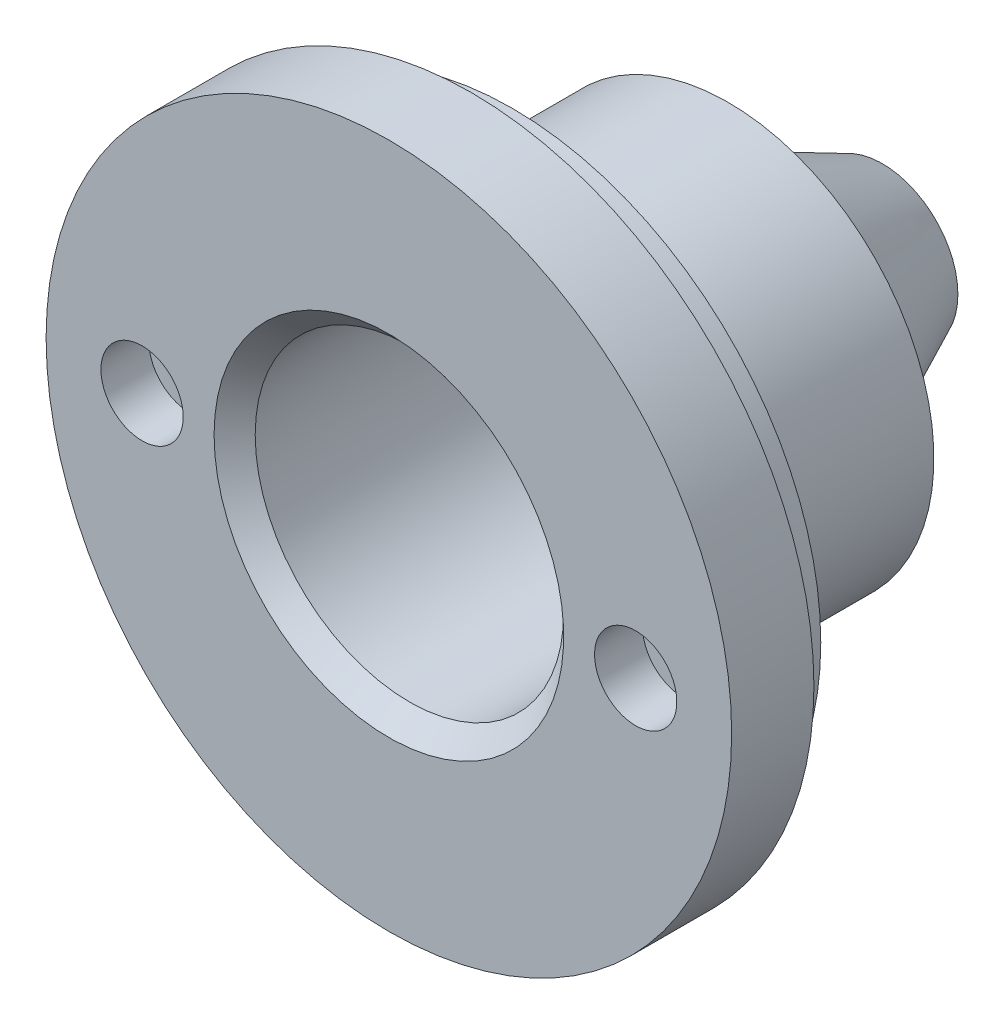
ISO-10303-21;
HEADER;
FILE_DESCRIPTION(('STEP AP214'),'2;1');
FILE_NAME('part.step','',(''),(''),'','','');
FILE_SCHEMA(('AUTOMOTIVE_DESIGN { 1 0 10303 214 1 1 1 1 }'));
ENDSEC;
DATA;
#1=APPLICATION_CONTEXT('core data for automotive mechanical design processes');
#2=APPLICATION_PROTOCOL_DEFINITION('international standard','automotive_design',2000,#1);
#3=PRODUCT_CONTEXT('',#1,'mechanical');
#4=PRODUCT('Part','Part','',(#3));
#5=PRODUCT_RELATED_PRODUCT_CATEGORY('part','',(#4));
#6=PRODUCT_DEFINITION_FORMATION('','',#4);
#7=PRODUCT_DEFINITION_CONTEXT('part definition',#1,'design');
#8=PRODUCT_DEFINITION('design','',#6,#7);
#9=PRODUCT_DEFINITION_SHAPE('','',#8);
#10=(LENGTH_UNIT() NAMED_UNIT(*) SI_UNIT(.MILLI.,.METRE.));
#11=(NAMED_UNIT(*) PLANE_ANGLE_UNIT() SI_UNIT($,.RADIAN.));
#12=(NAMED_UNIT(*) SI_UNIT($,.STERADIAN.) SOLID_ANGLE_UNIT());
#13=UNCERTAINTY_MEASURE_WITH_UNIT(LENGTH_MEASURE(1.E-05),#10,'distance_accuracy_value','');
#14=(GEOMETRIC_REPRESENTATION_CONTEXT(3) GLOBAL_UNCERTAINTY_ASSIGNED_CONTEXT((#13)) GLOBAL_UNIT_ASSIGNED_CONTEXT((#10,
#11,#12)) REPRESENTATION_CONTEXT('',''));
#15=CARTESIAN_POINT('',(0.,0.,0.));
#16=DIRECTION('',(0.,0.,1.));
#17=DIRECTION('',(1.,0.,0.));
#18=AXIS2_PLACEMENT_3D('',#15,#16,#17);
#19=CARTESIAN_POINT('',(0.,0.,-66.5002060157));
#20=DIRECTION('',(0.,0.,-1.));
#21=DIRECTION('',(0.479425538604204,0.877582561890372,0.));
#22=AXIS2_PLACEMENT_3D('',#19,#20,#21);
#23=TOROIDAL_SURFACE('',#22,7.804,0.5);
#24=CARTESIAN_POINT('',(0.,0.,-66.0002060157));
#25=DIRECTION('',(0.,0.,-1.));
#26=DIRECTION('',(0.479425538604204,0.877582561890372,0.));
#27=AXIS2_PLACEMENT_3D('',#24,#25,#26);
#28=CIRCLE('',#27,7.80399999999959);
#29=CARTESIAN_POINT('',(-3.74143690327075,-6.84865431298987,-66.0002060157));
#30=VERTEX_POINT('',#29);
#31=CARTESIAN_POINT('',(3.7414369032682,6.84865431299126,-66.0002060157));
#32=VERTEX_POINT('',#31);
#33=EDGE_CURVE('E45',#30,#32,#28,.F.);
#34=ORIENTED_EDGE('',*,*,#33,.F.);
#35=CARTESIAN_POINT('',(0.,0.,-66.0002060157));
#36=DIRECTION('',(0.,0.,-1.));
#37=DIRECTION('',(-0.479425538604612,-0.877582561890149,0.));
#38=AXIS2_PLACEMENT_3D('',#35,#36,#37);
#39=CIRCLE('',#38,7.80399999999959);
#40=EDGE_CURVE('E48',#32,#30,#39,.F.);
#41=ORIENTED_EDGE('',*,*,#40,.F.);
#42=EDGE_LOOP('',(#34,#41));
#43=FACE_BOUND('',#42,.T.);
#44=CARTESIAN_POINT('',(0.,0.,-66.6712160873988));
#45=DIRECTION('',(0.,0.,-1.));
#46=DIRECTION('',(0.479425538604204,0.877582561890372,0.));
#47=AXIS2_PLACEMENT_3D('',#44,#45,#46);
#48=CIRCLE('',#47,7.33415368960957);
#49=CARTESIAN_POINT('',(3.51618058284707,6.43632538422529,-66.6712160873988));
#50=VERTEX_POINT('',#49);
#51=EDGE_CURVE('E53',#50,#50,#48,.T.);
#52=ORIENTED_EDGE('',*,*,#51,.F.);
#53=EDGE_LOOP('',(#52));
#54=FACE_BOUND('',#53,.T.);
#55=ADVANCED_FACE('F16',(#43,#54),#23,.F.);
#56=CARTESIAN_POINT('',(0.,10.9995,-66.0002060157));
#57=DIRECTION('',(0.,0.,-1.));
#58=DIRECTION('',(-1.,0.,0.));
#59=AXIS2_PLACEMENT_3D('',#56,#57,#58);
#60=PLANE('',#59);
#61=ORIENTED_EDGE('',*,*,#33,.T.);
#62=ORIENTED_EDGE('',*,*,#40,.T.);
#63=EDGE_LOOP('',(#61,#62));
#64=FACE_BOUND('',#63,.T.);
#65=CARTESIAN_POINT('',(0.,0.,-66.0002060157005));
#66=DIRECTION('',(0.,0.,1.));
#67=DIRECTION('',(1.,0.,0.));
#68=AXIS2_PLACEMENT_3D('',#65,#66,#67);
#69=CIRCLE('',#68,10.9994999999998);
#70=CARTESIAN_POINT('',(10.9994999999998,0.,-66.0002060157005));
#71=VERTEX_POINT('',#70);
#72=EDGE_CURVE('E123',#71,#71,#69,.T.);
#73=ORIENTED_EDGE('',*,*,#72,.F.);
#74=EDGE_LOOP('',(#73));
#75=FACE_BOUND('',#74,.T.);
#76=ADVANCED_FACE('F50',(#64,#75),#60,.T.);
#77=CARTESIAN_POINT('',(0.,0.,-67.829807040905));
#78=DIRECTION('',(0.,0.,-1.));
#79=DIRECTION('',(-1.,0.,0.));
#80=AXIS2_PLACEMENT_3D('',#77,#78,#79);
#81=CONICAL_SURFACE('',#80,7.7558463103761,0.349065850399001);
#82=ORIENTED_EDGE('',*,*,#51,.T.);
#83=EDGE_LOOP('',(#82));
#84=FACE_BOUND('',#83,.T.);
#85=CARTESIAN_POINT('',(0.,0.,-67.8298070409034));
#86=DIRECTION('',(0.,0.,-1.));
#87=DIRECTION('',(0.479425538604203,0.877582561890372,0.));
#88=AXIS2_PLACEMENT_3D('',#85,#86,#87);
#89=CIRCLE('',#88,7.75584631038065);
#90=CARTESIAN_POINT('',(3.71835079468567,6.80639547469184,-67.8298070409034));
#91=VERTEX_POINT('',#90);
#92=EDGE_CURVE('E126',#91,#91,#89,.T.);
#93=ORIENTED_EDGE('',*,*,#92,.F.);
#94=EDGE_LOOP('',(#93));
#95=FACE_BOUND('',#94,.T.);
#96=ADVANCED_FACE('F85',(#84,#95),#81,.T.);
#97=CARTESIAN_POINT('',(0.,0.,-43.4999999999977));
#98=DIRECTION('',(0.,0.,1.));
#99=DIRECTION('',(1.,0.,0.));
#100=AXIS2_PLACEMENT_3D('',#97,#98,#99);
#101=CONICAL_SURFACE('',#100,21.4915183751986,0.436332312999);
#102=CARTESIAN_POINT('',(0.,0.,-43.4999999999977));
#103=DIRECTION('',(0.,0.,1.));
#104=DIRECTION('',(1.,0.,0.));
#105=AXIS2_PLACEMENT_3D('',#102,#103,#104);
#106=CIRCLE('',#105,21.4915183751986);
#107=CARTESIAN_POINT('',(21.4915183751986,0.,-43.4999999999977));
#108=VERTEX_POINT('',#107);
#109=EDGE_CURVE('E127',#108,#108,#106,.T.);
#110=ORIENTED_EDGE('',*,*,#109,.F.);
#111=EDGE_LOOP('',(#110));
#112=FACE_BOUND('',#111,.T.);
#113=ORIENTED_EDGE('',*,*,#72,.T.);
#114=EDGE_LOOP('',(#113));
#115=FACE_BOUND('',#114,.T.);
#116=ADVANCED_FACE('F104',(#112,#115),#101,.T.);
#117=CARTESIAN_POINT('',(0.,0.,-68.0008171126));
#118=DIRECTION('',(0.,0.,-1.));
#119=DIRECTION('',(0.479425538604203,0.877582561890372,0.));
#120=AXIS2_PLACEMENT_3D('',#117,#118,#119);
#121=TOROIDAL_SURFACE('',#120,7.286,0.5);
#122=ORIENTED_EDGE('',*,*,#92,.T.);
#123=EDGE_LOOP('',(#122));
#124=FACE_BOUND('',#123,.T.);
#125=CARTESIAN_POINT('',(0.,0.,-68.5008171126));
#126=DIRECTION('',(0.,0.,1.));
#127=DIRECTION('',(-0.479425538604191,-0.877582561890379,0.));
#128=AXIS2_PLACEMENT_3D('',#125,#126,#127);
#129=CIRCLE('',#128,7.28599999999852);
#130=CARTESIAN_POINT('',(3.49309447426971,6.39406654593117,-68.5008171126));
#131=VERTEX_POINT('',#130);
#132=CARTESIAN_POINT('',(-3.49309447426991,-6.39406654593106,-68.5008171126));
#133=VERTEX_POINT('',#132);
#134=EDGE_CURVE('E134',#131,#133,#129,.F.);
#135=ORIENTED_EDGE('',*,*,#134,.F.);
#136=CARTESIAN_POINT('',(0.,0.,-68.5008171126));
#137=DIRECTION('',(0.,0.,1.));
#138=DIRECTION('',(0.479425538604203,0.877582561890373,0.));
#139=AXIS2_PLACEMENT_3D('',#136,#137,#138);
#140=CIRCLE('',#139,7.28599999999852);
#141=EDGE_CURVE('E36',#133,#131,#140,.F.);
#142=ORIENTED_EDGE('',*,*,#141,.F.);
#143=EDGE_LOOP('',(#135,#142));
#144=FACE_BOUND('',#143,.T.);
#145=ADVANCED_FACE('F99',(#124,#144),#121,.T.);
#146=CARTESIAN_POINT('',(0.,29.9999999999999,-43.5));
#147=DIRECTION('',(0.,0.,-1.));
#148=DIRECTION('',(-1.,0.,0.));
#149=AXIS2_PLACEMENT_3D('',#146,#147,#148);
#150=PLANE('',#149);
#151=ORIENTED_EDGE('',*,*,#109,.T.);
#152=EDGE_LOOP('',(#151));
#153=FACE_BOUND('',#152,.T.);
#154=CARTESIAN_POINT('',(0.,0.,-43.5));
#155=DIRECTION('',(0.,0.,-1.));
#156=DIRECTION('',(-1.,0.,0.));
#157=AXIS2_PLACEMENT_3D('',#154,#155,#156);
#158=CIRCLE('',#157,30.);
#159=CARTESIAN_POINT('',(-30.,0.,-43.5));
#160=VERTEX_POINT('',#159);
#161=EDGE_CURVE('E130',#160,#160,#158,.F.);
#162=ORIENTED_EDGE('',*,*,#161,.F.);
#163=EDGE_LOOP('',(#162));
#164=FACE_BOUND('',#163,.T.);
#165=ADVANCED_FACE('F103',(#153,#164),#150,.T.);
#166=CARTESIAN_POINT('',(0.,7.286,-68.5008171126));
#167=DIRECTION('',(0.,0.,-1.));
#168=DIRECTION('',(-1.,0.,0.));
#169=AXIS2_PLACEMENT_3D('',#166,#167,#168);
#170=PLANE('',#169);
#171=CARTESIAN_POINT('',(0.,0.,-68.5008171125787));
#172=DIRECTION('',(0.,0.,-1.));
#173=DIRECTION('',(-1.,0.,0.));
#174=AXIS2_PLACEMENT_3D('',#171,#172,#173);
#175=CIRCLE('',#174,4.00999999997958);
#176=CARTESIAN_POINT('',(-4.00999999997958,0.,-68.5008171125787));
#177=VERTEX_POINT('',#176);
#178=EDGE_CURVE('E133',#177,#177,#175,.F.);
#179=ORIENTED_EDGE('',*,*,#178,.T.);
#180=EDGE_LOOP('',(#179));
#181=FACE_BOUND('',#180,.T.);
#182=ORIENTED_EDGE('',*,*,#141,.T.);
#183=ORIENTED_EDGE('',*,*,#134,.T.);
#184=EDGE_LOOP('',(#182,#183));
#185=FACE_BOUND('',#184,.T.);
#186=ADVANCED_FACE('F247',(#181,#185),#170,.T.);
#187=CARTESIAN_POINT('',(0.,0.,-31.2502516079));
#188=DIRECTION('',(0.,0.,-1.));
#189=DIRECTION('',(-1.,0.,0.));
#190=AXIS2_PLACEMENT_3D('',#187,#188,#189);
#191=CYLINDRICAL_SURFACE('',#190,30.);
#192=CARTESIAN_POINT('',(0.,0.,-12.));
#193=DIRECTION('',(0.,0.,-1.));
#194=DIRECTION('',(-1.,0.,0.));
#195=AXIS2_PLACEMENT_3D('',#192,#193,#194);
#196=CIRCLE('',#195,30.);
#197=CARTESIAN_POINT('',(-30.,0.,-12.));
#198=VERTEX_POINT('',#197);
#199=EDGE_CURVE('E137',#198,#198,#196,.F.);
#200=ORIENTED_EDGE('',*,*,#199,.F.);
#201=EDGE_LOOP('',(#200));
#202=FACE_BOUND('',#201,.T.);
#203=ORIENTED_EDGE('',*,*,#161,.T.);
#204=EDGE_LOOP('',(#203));
#205=FACE_BOUND('',#204,.T.);
#206=ADVANCED_FACE('F258',(#202,#205),#191,.T.);
#207=CARTESIAN_POINT('',(0.,0.,-68.5008171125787));
#208=DIRECTION('',(0.,0.,-1.));
#209=DIRECTION('',(-1.,0.,0.));
#210=AXIS2_PLACEMENT_3D('',#207,#208,#209);
#211=CONICAL_SURFACE('',#210,4.00999999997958,0.261799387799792);
#212=ORIENTED_EDGE('',*,*,#178,.F.);
#213=EDGE_LOOP('',(#212));
#214=FACE_BOUND('',#213,.T.);
#215=CARTESIAN_POINT('',(0.,0.,-61.000403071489));
#216=DIRECTION('',(0.,0.,1.));
#217=DIRECTION('',(0.479425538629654,0.877582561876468,0.));
#218=AXIS2_PLACEMENT_3D('',#215,#216,#217);
#219=CIRCLE('',#218,2.0002701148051);
#220=CARTESIAN_POINT('',(2.00027011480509,0.,-61.000403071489));
#221=VERTEX_POINT('',#220);
#222=EDGE_CURVE('E140',#221,#221,#219,.T.);
#223=ORIENTED_EDGE('',*,*,#222,.T.);
#224=EDGE_LOOP('',(#223));
#225=FACE_BOUND('',#224,.T.);
#226=ADVANCED_FACE('F263',(#214,#225),#211,.F.);
#227=CARTESIAN_POINT('',(0.,45.,-12.));
#228=DIRECTION('',(0.,0.,-1.));
#229=DIRECTION('',(-1.,0.,0.));
#230=AXIS2_PLACEMENT_3D('',#227,#228,#229);
#231=PLANE('',#230);
#232=ORIENTED_EDGE('',*,*,#199,.T.);
#233=EDGE_LOOP('',(#232));
#234=FACE_BOUND('',#233,.T.);
#235=CARTESIAN_POINT('',(36.,0.,-12.));
#236=DIRECTION('',(0.,0.,-1.));
#237=DIRECTION('',(-1.,0.,0.));
#238=AXIS2_PLACEMENT_3D('',#235,#236,#237);
#239=CIRCLE('',#238,3.3);
#240=CARTESIAN_POINT('',(32.7,0.,-12.));
#241=VERTEX_POINT('',#240);
#242=EDGE_CURVE('E147',#241,#241,#239,.F.);
#243=ORIENTED_EDGE('',*,*,#242,.T.);
#244=EDGE_LOOP('',(#243));
#245=FACE_BOUND('',#244,.T.);
#246=CARTESIAN_POINT('',(-36.,0.,-12.));
#247=DIRECTION('',(0.,0.,-1.));
#248=DIRECTION('',(-1.,0.,0.));
#249=AXIS2_PLACEMENT_3D('',#246,#247,#248);
#250=CIRCLE('',#249,3.3);
#251=CARTESIAN_POINT('',(-39.3,0.,-12.));
#252=VERTEX_POINT('',#251);
#253=EDGE_CURVE('E144',#252,#252,#250,.F.);
#254=ORIENTED_EDGE('',*,*,#253,.T.);
#255=EDGE_LOOP('',(#254));
#256=FACE_BOUND('',#255,.T.);
#257=CARTESIAN_POINT('',(0.,0.,-12.));
#258=DIRECTION('',(0.,0.,-1.));
#259=DIRECTION('',(-1.,0.,0.));
#260=AXIS2_PLACEMENT_3D('',#257,#258,#259);
#261=CIRCLE('',#260,45.);
#262=CARTESIAN_POINT('',(-45.,0.,-12.));
#263=VERTEX_POINT('',#262);
#264=EDGE_CURVE('E141',#263,#263,#261,.F.);
#265=ORIENTED_EDGE('',*,*,#264,.F.);
#266=EDGE_LOOP('',(#265));
#267=FACE_BOUND('',#266,.T.);
#268=ADVANCED_FACE('F267',(#234,#245,#256,#267),#231,.T.);
#269=CARTESIAN_POINT('',(0.,0.,-55.2269030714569));
#270=DIRECTION('',(0.,0.,1.));
#271=DIRECTION('',(1.,0.,0.));
#272=AXIS2_PLACEMENT_3D('',#269,#270,#271);
#273=CONICAL_SURFACE('',#272,12.0002654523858,1.04719755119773);
#274=CARTESIAN_POINT('',(0.,0.,-55.2269030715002));
#275=DIRECTION('',(0.,0.,1.));
#276=DIRECTION('',(0.479425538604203,0.877582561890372,0.));
#277=AXIS2_PLACEMENT_3D('',#274,#275,#276);
#278=CIRCLE('',#277,12.0002654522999);
#279=CARTESIAN_POINT('',(12.0002654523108,0.,-55.2269030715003));
#280=VERTEX_POINT('',#279);
#281=EDGE_CURVE('E150',#280,#280,#278,.T.);
#282=CARTESIAN_POINT('',(2.00027011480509,0.,-61.000403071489));
#283=CARTESIAN_POINT('',(2.10443673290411,0.,-60.9402624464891));
#284=CARTESIAN_POINT('',(2.20860335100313,0.,-60.8801218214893));
#285=CARTESIAN_POINT('',(2.41693658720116,0.,-60.7598405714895));
#286=CARTESIAN_POINT('',(2.52110320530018,0.,-60.6996999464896));
#287=CARTESIAN_POINT('',(2.72943644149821,0.,-60.5794186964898));
#288=CARTESIAN_POINT('',(2.83360305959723,0.,-60.51927807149));
#289=CARTESIAN_POINT('',(3.04193629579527,0.,-60.3989968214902));
#290=CARTESIAN_POINT('',(3.14610291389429,0.,-60.3388561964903));
#291=CARTESIAN_POINT('',(3.35443615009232,0.,-60.2185749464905));
#292=CARTESIAN_POINT('',(3.45860276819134,0.,-60.1584343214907));
#293=CARTESIAN_POINT('',(3.66693600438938,0.,-60.0381530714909));
#294=CARTESIAN_POINT('',(3.77110262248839,0.,-59.978012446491));
#295=CARTESIAN_POINT('',(3.97943585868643,0.,-59.8577311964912));
#296=CARTESIAN_POINT('',(4.08360247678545,0.,-59.7975905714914));
#297=CARTESIAN_POINT('',(4.29193571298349,0.,-59.6773093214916));
#298=CARTESIAN_POINT('',(4.3961023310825,0.,-59.6171686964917));
#299=CARTESIAN_POINT('',(4.60443556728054,0.,-59.4968874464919));
#300=CARTESIAN_POINT('',(4.70860218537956,0.,-59.4367468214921));
#301=CARTESIAN_POINT('',(4.91693542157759,0.,-59.3164655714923));
#302=CARTESIAN_POINT('',(5.02110203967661,0.,-59.2563249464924));
#303=CARTESIAN_POINT('',(5.22943527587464,0.,-59.1360436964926));
#304=CARTESIAN_POINT('',(5.33360189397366,0.,-59.0759030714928));
#305=CARTESIAN_POINT('',(5.5419351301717,0.,-58.955621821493));
#306=CARTESIAN_POINT('',(5.64610174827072,0.,-58.8954811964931));
#307=CARTESIAN_POINT('',(5.85443498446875,0.,-58.7751999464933));
#308=CARTESIAN_POINT('',(5.95860160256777,0.,-58.7150593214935));
#309=CARTESIAN_POINT('',(6.16693483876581,0.,-58.5947780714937));
#310=CARTESIAN_POINT('',(6.27110145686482,0.,-58.5346374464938));
#311=CARTESIAN_POINT('',(6.47943469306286,0.,-58.414356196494));
#312=CARTESIAN_POINT('',(6.58360131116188,0.,-58.3542155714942));
#313=CARTESIAN_POINT('',(6.79193454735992,0.,-58.2339343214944));
#314=CARTESIAN_POINT('',(6.89610116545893,0.,-58.1737936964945));
#315=CARTESIAN_POINT('',(7.10443440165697,0.,-58.0535124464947));
#316=CARTESIAN_POINT('',(7.20860101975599,0.,-57.9933718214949));
#317=CARTESIAN_POINT('',(7.41693425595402,0.,-57.8730905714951));
#318=CARTESIAN_POINT('',(7.52110087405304,0.,-57.8129499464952));
#319=CARTESIAN_POINT('',(7.72943411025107,0.,-57.6926686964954));
#320=CARTESIAN_POINT('',(7.83360072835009,0.,-57.6325280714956));
#321=CARTESIAN_POINT('',(8.04193396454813,0.,-57.5122468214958));
#322=CARTESIAN_POINT('',(8.14610058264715,0.,-57.4521061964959));
#323=CARTESIAN_POINT('',(8.35443381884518,0.,-57.3318249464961));
#324=CARTESIAN_POINT('',(8.4586004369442,0.,-57.2716843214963));
#325=CARTESIAN_POINT('',(8.66693367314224,0.,-57.1514030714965));
#326=CARTESIAN_POINT('',(8.77110029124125,0.,-57.0912624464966));
#327=CARTESIAN_POINT('',(8.97943352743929,0.,-56.9709811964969));
#328=CARTESIAN_POINT('',(9.08360014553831,0.,-56.910840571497));
#329=CARTESIAN_POINT('',(9.29193338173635,0.,-56.7905593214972));
#330=CARTESIAN_POINT('',(9.39609999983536,0.,-56.7304186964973));
#331=CARTESIAN_POINT('',(9.6044332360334,0.,-56.6101374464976));
#332=CARTESIAN_POINT('',(9.70859985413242,0.,-56.5499968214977));
#333=CARTESIAN_POINT('',(9.91693309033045,0.,-56.4297155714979));
#334=CARTESIAN_POINT('',(10.0210997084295,0.,-56.369574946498));
#335=CARTESIAN_POINT('',(10.2294329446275,0.,-56.2492936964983));
#336=CARTESIAN_POINT('',(10.3335995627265,0.,-56.1891530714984));
#337=CARTESIAN_POINT('',(10.5419327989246,0.,-56.0688718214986));
#338=CARTESIAN_POINT('',(10.6460994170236,0.,-56.0087311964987));
#339=CARTESIAN_POINT('',(10.8544326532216,0.,-55.888449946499));
#340=CARTESIAN_POINT('',(10.9585992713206,0.,-55.8283093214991));
#341=CARTESIAN_POINT('',(11.1669325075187,0.,-55.7080280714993));
#342=CARTESIAN_POINT('',(11.2710991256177,0.,-55.6478874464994));
#343=CARTESIAN_POINT('',(11.4794323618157,0.,-55.5276061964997));
#344=CARTESIAN_POINT('',(11.5835989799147,0.,-55.4674655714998));
#345=CARTESIAN_POINT('',(11.7919322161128,0.,-55.3471843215));
#346=CARTESIAN_POINT('',(11.8960988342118,0.,-55.2870436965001));
#347=CARTESIAN_POINT('',(12.0002654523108,0.,-55.2269030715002));
#348=B_SPLINE_CURVE_WITH_KNOTS('',3,(#282,#283,#284,#285,#286,#287,#288,#289,#290,#291,#292,
#293,#294,#295,#296,#297,#298,#299,#300,#301,#302,#303,#304,#305,#306,#307,#308,#309,#310,#311,
#312,#313,#314,#315,#316,#317,#318,#319,#320,#321,#322,#323,#324,#325,#326,#327,#328,#329,#330,
#331,#332,#333,#334,#335,#336,#337,#338,#339,#340,#341,#342,#343,#344,#345,#346,#347),
.UNSPECIFIED.,.F.,.F.,(4,2,2,2,2,2,2,2,2,2,2,2,2,2,2,2,2,2,2,2,2,2,2,2,2,2,2,2,2,2,2,2,4),(0.,
0.360843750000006,0.721687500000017,1.08253125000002,1.44337500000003,1.80421875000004,
2.16506250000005,2.52590625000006,2.88675000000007,3.24759375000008,3.60843750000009,
3.96928125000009,4.33012500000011,4.69096875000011,5.05181250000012,5.41265625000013,
5.77350000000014,6.13434375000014,6.49518750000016,6.85603125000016,7.21687500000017,
7.57771875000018,7.93856250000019,8.2994062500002,8.66025000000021,9.02109375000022,
9.38193750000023,9.74278125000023,10.1036250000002,10.4644687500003,10.8253125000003,
11.1861562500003,11.5470000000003),.UNSPECIFIED.);
#349=EDGE_CURVE('BSEAM271',#221,#280,#348,.T.);
#350=ORIENTED_EDGE('',*,*,#222,.F.);
#351=ORIENTED_EDGE('',*,*,#281,.T.);
#352=ORIENTED_EDGE('',*,*,#349,.T.);
#353=ORIENTED_EDGE('',*,*,#349,.F.);
#354=EDGE_LOOP('',(#350,#352,#351,#353));
#355=FACE_BOUND('',#354,.T.);
#356=ADVANCED_FACE('F271',(#355),#273,.F.);
#357=CARTESIAN_POINT('',(0.,0.,-31.2502516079));
#358=DIRECTION('',(0.,0.,-1.));
#359=DIRECTION('',(-1.,0.,0.));
#360=AXIS2_PLACEMENT_3D('',#357,#358,#359);
#361=CYLINDRICAL_SURFACE('',#360,45.);
#362=CARTESIAN_POINT('',(0.,0.,-6.00000000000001));
#363=DIRECTION('',(0.,0.,-1.));
#364=DIRECTION('',(-1.,0.,0.));
#365=AXIS2_PLACEMENT_3D('',#362,#363,#364);
#366=CIRCLE('',#365,45.);
#367=CARTESIAN_POINT('',(-45.,0.,-6.00000000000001));
#368=VERTEX_POINT('',#367);
#369=EDGE_CURVE('E151',#368,#368,#366,.F.);
#370=ORIENTED_EDGE('',*,*,#369,.F.);
#371=EDGE_LOOP('',(#370));
#372=FACE_BOUND('',#371,.T.);
#373=ORIENTED_EDGE('',*,*,#264,.T.);
#374=EDGE_LOOP('',(#373));
#375=FACE_BOUND('',#374,.T.);
#376=ADVANCED_FACE('F275',(#372,#375),#361,.T.);
#377=CARTESIAN_POINT('',(-36.,0.,5.89999999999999));
#378=DIRECTION('',(0.,0.,-1.));
#379=DIRECTION('',(-1.,0.,0.));
#380=AXIS2_PLACEMENT_3D('',#377,#378,#379);
#381=CYLINDRICAL_SURFACE('',#380,3.3);
#382=CARTESIAN_POINT('',(-36.,0.,-1.));
#383=DIRECTION('',(0.,0.,-1.));
#384=DIRECTION('',(-1.,0.,0.));
#385=AXIS2_PLACEMENT_3D('',#382,#383,#384);
#386=CIRCLE('',#385,3.3);
#387=CARTESIAN_POINT('',(-39.3,0.,-1.));
#388=VERTEX_POINT('',#387);
#389=EDGE_CURVE('E154',#388,#388,#386,.F.);
#390=ORIENTED_EDGE('',*,*,#389,.T.);
#391=EDGE_LOOP('',(#390));
#392=FACE_BOUND('',#391,.T.);
#393=ORIENTED_EDGE('',*,*,#253,.F.);
#394=EDGE_LOOP('',(#393));
#395=FACE_BOUND('',#394,.T.);
#396=ADVANCED_FACE('F279',(#392,#395),#381,.F.);
#397=CARTESIAN_POINT('',(36.,0.,5.89999999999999));
#398=DIRECTION('',(0.,0.,-1.));
#399=DIRECTION('',(-1.,0.,0.));
#400=AXIS2_PLACEMENT_3D('',#397,#398,#399);
#401=CYLINDRICAL_SURFACE('',#400,3.3);
#402=CARTESIAN_POINT('',(36.,0.,-1.));
#403=DIRECTION('',(0.,0.,-1.));
#404=DIRECTION('',(-1.,0.,0.));
#405=AXIS2_PLACEMENT_3D('',#402,#403,#404);
#406=CIRCLE('',#405,3.3);
#407=CARTESIAN_POINT('',(32.7,0.,-1.));
#408=VERTEX_POINT('',#407);
#409=EDGE_CURVE('E157',#408,#408,#406,.F.);
#410=ORIENTED_EDGE('',*,*,#409,.T.);
#411=EDGE_LOOP('',(#410));
#412=FACE_BOUND('',#411,.T.);
#413=ORIENTED_EDGE('',*,*,#242,.F.);
#414=EDGE_LOOP('',(#413));
#415=FACE_BOUND('',#414,.T.);
#416=ADVANCED_FACE('F211',(#412,#415),#401,.F.);
#417=CARTESIAN_POINT('',(0.,0.,-32.7096861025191));
#418=DIRECTION('',(0.,0.,1.));
#419=DIRECTION('',(1.,0.,0.));
#420=AXIS2_PLACEMENT_3D('',#417,#418,#419);
#421=CONICAL_SURFACE('',#420,22.5002161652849,0.436332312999);
#422=ORIENTED_EDGE('',*,*,#281,.F.);
#423=EDGE_LOOP('',(#422));
#424=FACE_BOUND('',#423,.T.);
#425=CARTESIAN_POINT('',(0.,0.,-32.7096861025));
#426=DIRECTION('',(0.,0.,-1.));
#427=DIRECTION('',(-1.,0.,0.));
#428=AXIS2_PLACEMENT_3D('',#425,#426,#427);
#429=CIRCLE('',#428,22.5002161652);
#430=CARTESIAN_POINT('',(-22.5002161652,0.,-32.7096861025));
#431=VERTEX_POINT('',#430);
#432=EDGE_CURVE('E160',#431,#431,#429,.F.);
#433=ORIENTED_EDGE('',*,*,#432,.T.);
#434=EDGE_LOOP('',(#433));
#435=FACE_BOUND('',#434,.T.);
#436=ADVANCED_FACE('F200',(#424,#435),#421,.F.);
#437=CARTESIAN_POINT('',(0.,50.,-6.00000000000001));
#438=DIRECTION('',(0.,0.,-1.));
#439=DIRECTION('',(-1.,0.,0.));
#440=AXIS2_PLACEMENT_3D('',#437,#438,#439);
#441=PLANE('',#440);
#442=ORIENTED_EDGE('',*,*,#369,.T.);
#443=EDGE_LOOP('',(#442));
#444=FACE_BOUND('',#443,.T.);
#445=CARTESIAN_POINT('',(0.,0.,-6.00000000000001));
#446=DIRECTION('',(0.,0.,-1.));
#447=DIRECTION('',(-1.,0.,0.));
#448=AXIS2_PLACEMENT_3D('',#445,#446,#447);
#449=CIRCLE('',#448,50.);
#450=CARTESIAN_POINT('',(-50.,0.,-6.00000000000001));
#451=VERTEX_POINT('',#450);
#452=EDGE_CURVE('E161',#451,#451,#449,.F.);
#453=ORIENTED_EDGE('',*,*,#452,.F.);
#454=EDGE_LOOP('',(#453));
#455=FACE_BOUND('',#454,.T.);
#456=ADVANCED_FACE('F197',(#444,#455),#441,.T.);
#457=CARTESIAN_POINT('',(39.3,0.,-1.));
#458=DIRECTION('',(0.,0.,-1.));
#459=DIRECTION('',(-1.,0.,0.));
#460=AXIS2_PLACEMENT_3D('',#457,#458,#459);
#461=PLANE('',#460);
#462=ORIENTED_EDGE('',*,*,#389,.F.);
#463=EDGE_LOOP('',(#462));
#464=FACE_BOUND('',#463,.T.);
#465=CARTESIAN_POINT('',(-36.,0.,-1.));
#466=DIRECTION('',(0.,0.,-1.));
#467=DIRECTION('',(-1.,0.,0.));
#468=AXIS2_PLACEMENT_3D('',#465,#466,#467);
#469=CIRCLE('',#468,6.);
#470=CARTESIAN_POINT('',(-42.,0.,-1.));
#471=VERTEX_POINT('',#470);
#472=EDGE_CURVE('E164',#471,#471,#469,.F.);
#473=ORIENTED_EDGE('',*,*,#472,.T.);
#474=EDGE_LOOP('',(#473));
#475=FACE_BOUND('',#474,.T.);
#476=ADVANCED_FACE('F199',(#464,#475),#461,.F.);
#477=CARTESIAN_POINT('',(39.3,0.,-1.));
#478=DIRECTION('',(0.,0.,-1.));
#479=DIRECTION('',(-1.,0.,0.));
#480=AXIS2_PLACEMENT_3D('',#477,#478,#479);
#481=PLANE('',#480);
#482=ORIENTED_EDGE('',*,*,#409,.F.);
#483=EDGE_LOOP('',(#482));
#484=FACE_BOUND('',#483,.T.);
#485=CARTESIAN_POINT('',(36.,0.,-1.));
#486=DIRECTION('',(0.,0.,-1.));
#487=DIRECTION('',(-1.,0.,0.));
#488=AXIS2_PLACEMENT_3D('',#485,#486,#487);
#489=CIRCLE('',#488,6.);
#490=CARTESIAN_POINT('',(30.,0.,-1.));
#491=VERTEX_POINT('',#490);
#492=EDGE_CURVE('E167',#491,#491,#489,.F.);
#493=ORIENTED_EDGE('',*,*,#492,.T.);
#494=EDGE_LOOP('',(#493));
#495=FACE_BOUND('',#494,.T.);
#496=ADVANCED_FACE('F208',(#484,#495),#481,.F.);
#497=CARTESIAN_POINT('',(0.,0.,-31.2502516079));
#498=DIRECTION('',(0.,0.,-1.));
#499=DIRECTION('',(-1.,0.,0.));
#500=AXIS2_PLACEMENT_3D('',#497,#498,#499);
#501=CYLINDRICAL_SURFACE('',#500,22.5002161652);
#502=ORIENTED_EDGE('',*,*,#432,.F.);
#503=EDGE_LOOP('',(#502));
#504=FACE_BOUND('',#503,.T.);
#505=CARTESIAN_POINT('',(0.,0.,3.00031389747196));
#506=DIRECTION('',(0.,0.,1.));
#507=DIRECTION('',(0.479425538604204,0.877582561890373,0.));
#508=AXIS2_PLACEMENT_3D('',#505,#506,#507);
#509=CIRCLE('',#508,22.500216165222);
#510=CARTESIAN_POINT('',(10.7871782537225,19.7457973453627,3.00031389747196));
#511=VERTEX_POINT('',#510);
#512=EDGE_CURVE('E170',#511,#511,#509,.T.);
#513=ORIENTED_EDGE('',*,*,#512,.T.);
#514=EDGE_LOOP('',(#513));
#515=FACE_BOUND('',#514,.T.);
#516=ADVANCED_FACE('F193',(#504,#515),#501,.F.);
#517=CARTESIAN_POINT('',(0.,0.,-31.2502516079));
#518=DIRECTION('',(0.,0.,-1.));
#519=DIRECTION('',(-1.,0.,0.));
#520=AXIS2_PLACEMENT_3D('',#517,#518,#519);
#521=CYLINDRICAL_SURFACE('',#520,50.);
#522=CARTESIAN_POINT('',(0.,0.,6.00000000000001));
#523=DIRECTION('',(0.,0.,-1.));
#524=DIRECTION('',(-1.,0.,0.));
#525=AXIS2_PLACEMENT_3D('',#522,#523,#524);
#526=CIRCLE('',#525,50.);
#527=CARTESIAN_POINT('',(-50.,0.,6.00000000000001));
#528=VERTEX_POINT('',#527);
#529=EDGE_CURVE('E171',#528,#528,#526,.T.);
#530=ORIENTED_EDGE('',*,*,#529,.T.);
#531=EDGE_LOOP('',(#530));
#532=FACE_BOUND('',#531,.T.);
#533=ORIENTED_EDGE('',*,*,#452,.T.);
#534=EDGE_LOOP('',(#533));
#535=FACE_BOUND('',#534,.T.);
#536=ADVANCED_FACE('F189',(#532,#535),#521,.T.);
#537=CARTESIAN_POINT('',(-36.,0.,5.89999999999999));
#538=DIRECTION('',(0.,0.,-1.));
#539=DIRECTION('',(-1.,0.,0.));
#540=AXIS2_PLACEMENT_3D('',#537,#538,#539);
#541=CYLINDRICAL_SURFACE('',#540,6.);
#542=ORIENTED_EDGE('',*,*,#472,.F.);
#543=EDGE_LOOP('',(#542));
#544=FACE_BOUND('',#543,.T.);
#545=CARTESIAN_POINT('',(-36.,0.,6.00000000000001));
#546=DIRECTION('',(0.,0.,-1.));
#547=DIRECTION('',(-1.,0.,0.));
#548=AXIS2_PLACEMENT_3D('',#545,#546,#547);
#549=CIRCLE('',#548,6.);
#550=CARTESIAN_POINT('',(-42.,0.,6.00000000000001));
#551=VERTEX_POINT('',#550);
#552=EDGE_CURVE('E174',#551,#551,#549,.F.);
#553=ORIENTED_EDGE('',*,*,#552,.T.);
#554=EDGE_LOOP('',(#553));
#555=FACE_BOUND('',#554,.T.);
#556=ADVANCED_FACE('F192',(#544,#555),#541,.F.);
#557=CARTESIAN_POINT('',(36.,0.,5.89999999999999));
#558=DIRECTION('',(0.,0.,-1.));
#559=DIRECTION('',(-1.,0.,0.));
#560=AXIS2_PLACEMENT_3D('',#557,#558,#559);
#561=CYLINDRICAL_SURFACE('',#560,6.);
#562=ORIENTED_EDGE('',*,*,#492,.F.);
#563=EDGE_LOOP('',(#562));
#564=FACE_BOUND('',#563,.T.);
#565=CARTESIAN_POINT('',(36.,0.,6.00000000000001));
#566=DIRECTION('',(0.,0.,-1.));
#567=DIRECTION('',(-1.,0.,0.));
#568=AXIS2_PLACEMENT_3D('',#565,#566,#567);
#569=CIRCLE('',#568,6.);
#570=CARTESIAN_POINT('',(30.,0.,6.00000000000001));
#571=VERTEX_POINT('',#570);
#572=EDGE_CURVE('E28',#571,#571,#569,.F.);
#573=ORIENTED_EDGE('',*,*,#572,.T.);
#574=EDGE_LOOP('',(#573));
#575=FACE_BOUND('',#574,.T.);
#576=ADVANCED_FACE('F179',(#564,#575),#561,.F.);
#577=CARTESIAN_POINT('',(0.,0.,6.00031389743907));
#578=DIRECTION('',(0.,0.,1.));
#579=DIRECTION('',(1.,0.,0.));
#580=AXIS2_PLACEMENT_3D('',#577,#578,#579);
#581=CONICAL_SURFACE('',#580,25.5002161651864,0.785398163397);
#582=ORIENTED_EDGE('',*,*,#512,.F.);
#583=EDGE_LOOP('',(#582));
#584=FACE_BOUND('',#583,.T.);
#585=CARTESIAN_POINT('',(0.,0.,6.00000000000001));
#586=DIRECTION('',(0.,0.,-1.));
#587=DIRECTION('',(-1.,0.,0.));
#588=AXIS2_PLACEMENT_3D('',#585,#586,#587);
#589=CIRCLE('',#588,25.4999022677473);
#590=CARTESIAN_POINT('',(-25.4999022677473,0.,6.00000000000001));
#591=VERTEX_POINT('',#590);
#592=EDGE_CURVE('E11',#591,#591,#589,.F.);
#593=ORIENTED_EDGE('',*,*,#592,.T.);
#594=EDGE_LOOP('',(#593));
#595=FACE_BOUND('',#594,.T.);
#596=ADVANCED_FACE('F183',(#584,#595),#581,.F.);
#597=CARTESIAN_POINT('',(0.,50.,6.00000000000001));
#598=DIRECTION('',(0.,0.,-1.));
#599=DIRECTION('',(-1.,0.,0.));
#600=AXIS2_PLACEMENT_3D('',#597,#598,#599);
#601=PLANE('',#600);
#602=ORIENTED_EDGE('',*,*,#592,.F.);
#603=EDGE_LOOP('',(#602));
#604=FACE_BOUND('',#603,.T.);
#605=ORIENTED_EDGE('',*,*,#572,.F.);
#606=EDGE_LOOP('',(#605));
#607=FACE_BOUND('',#606,.T.);
#608=ORIENTED_EDGE('',*,*,#552,.F.);
#609=EDGE_LOOP('',(#608));
#610=FACE_BOUND('',#609,.T.);
#611=ORIENTED_EDGE('',*,*,#529,.F.);
#612=EDGE_LOOP('',(#611));
#613=FACE_BOUND('',#612,.T.);
#614=ADVANCED_FACE('F18',(#604,#607,#610,#613),#601,.F.);
#615=CLOSED_SHELL('',(#55,#76,#96,#116,#145,#165,#186,#206,#226,#268,#356,#376,#396,#416,#436,
#456,#476,#496,#516,#536,#556,#576,#596,#614));
#616=MANIFOLD_SOLID_BREP('B1',#615);
#617=ADVANCED_BREP_SHAPE_REPRESENTATION('',(#18,#616),#14);
#618=SHAPE_DEFINITION_REPRESENTATION(#9,#617);
ENDSEC;
END-ISO-10303-21;
